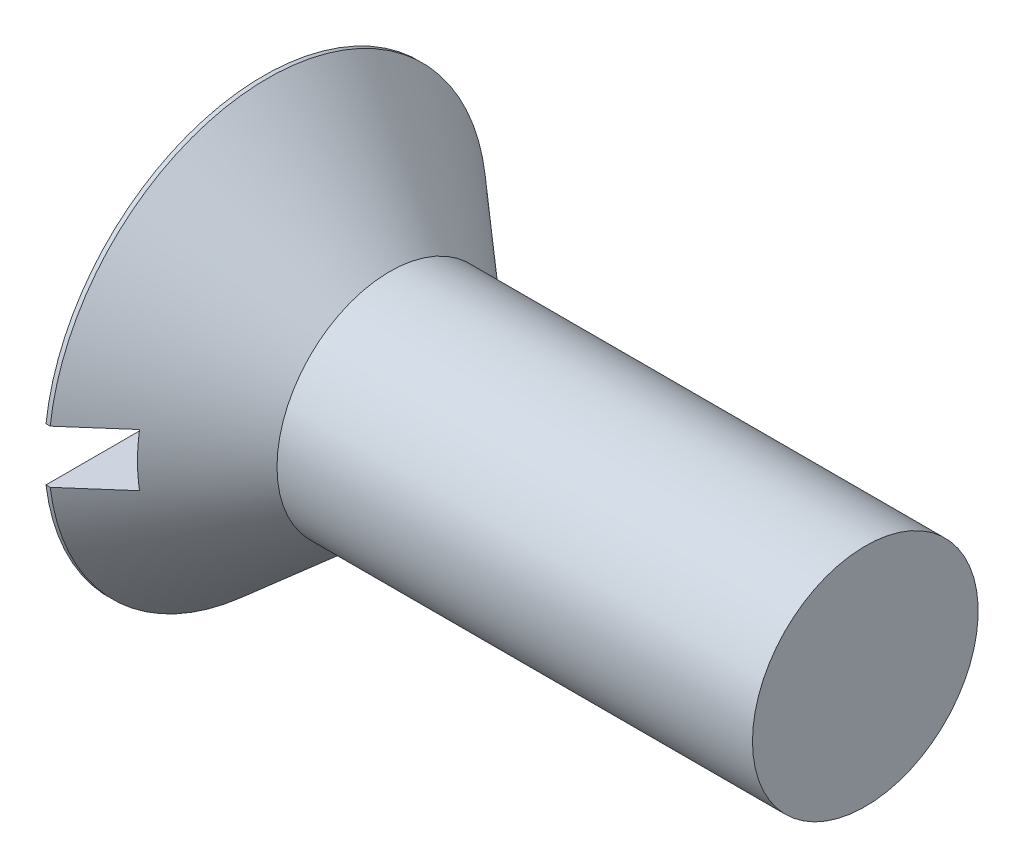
ISO-10303-21;
HEADER;
FILE_DESCRIPTION(('STEP AP214'),'2;1');
FILE_NAME('part.step','',(''),(''),'','','');
FILE_SCHEMA(('AUTOMOTIVE_DESIGN { 1 0 10303 214 1 1 1 1 }'));
ENDSEC;
DATA;
#1=APPLICATION_CONTEXT('core data for automotive mechanical design processes');
#2=APPLICATION_PROTOCOL_DEFINITION('international standard','automotive_design',2000,#1);
#3=PRODUCT_CONTEXT('',#1,'mechanical');
#4=PRODUCT('Part','Part','',(#3));
#5=PRODUCT_RELATED_PRODUCT_CATEGORY('part','',(#4));
#6=PRODUCT_DEFINITION_FORMATION('','',#4);
#7=PRODUCT_DEFINITION_CONTEXT('part definition',#1,'design');
#8=PRODUCT_DEFINITION('design','',#6,#7);
#9=PRODUCT_DEFINITION_SHAPE('','',#8);
#10=(LENGTH_UNIT() NAMED_UNIT(*) SI_UNIT(.MILLI.,.METRE.));
#11=(NAMED_UNIT(*) PLANE_ANGLE_UNIT() SI_UNIT($,.RADIAN.));
#12=(NAMED_UNIT(*) SI_UNIT($,.STERADIAN.) SOLID_ANGLE_UNIT());
#13=UNCERTAINTY_MEASURE_WITH_UNIT(LENGTH_MEASURE(1.E-05),#10,'distance_accuracy_value','');
#14=(GEOMETRIC_REPRESENTATION_CONTEXT(3) GLOBAL_UNCERTAINTY_ASSIGNED_CONTEXT((#13)) GLOBAL_UNIT_ASSIGNED_CONTEXT((#10,
#11,#12)) REPRESENTATION_CONTEXT('',''));
#15=CARTESIAN_POINT('',(0.,0.,0.));
#16=DIRECTION('',(0.,0.,1.));
#17=DIRECTION('',(1.,0.,0.));
#18=AXIS2_PLACEMENT_3D('',#15,#16,#17);
#19=CARTESIAN_POINT('',(0.,0.,0.));
#20=DIRECTION('',(-1.,0.,0.));
#21=DIRECTION('',(0.,0.,1.));
#22=AXIS2_PLACEMENT_3D('',#19,#20,#21);
#23=PLANE('',#22);
#24=DIRECTION('',(0.,0.,-1.));
#25=VECTOR('',#24,1.);
#26=CARTESIAN_POINT('',(0.,1.1176,9.2456));
#27=LINE('',#26,#25);
#28=CARTESIAN_POINT('',(0.,1.1176,9.17780418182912));
#29=VERTEX_POINT('',#28);
#30=CARTESIAN_POINT('',(0.,1.1176,-9.17780418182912));
#31=VERTEX_POINT('',#30);
#32=EDGE_CURVE('E160',#29,#31,#27,.T.);
#33=ORIENTED_EDGE('',*,*,#32,.F.);
#34=CARTESIAN_POINT('',(0.,0.,0.));
#35=DIRECTION('',(-1.,0.,0.));
#36=DIRECTION('',(0.,0.,1.));
#37=AXIS2_PLACEMENT_3D('',#34,#35,#36);
#38=CIRCLE('',#37,9.2456);
#39=EDGE_CURVE('E111',#29,#31,#38,.T.);
#40=ORIENTED_EDGE('',*,*,#39,.T.);
#41=EDGE_LOOP('',(#33,#40));
#42=FACE_BOUND('',#41,.T.);
#43=ADVANCED_FACE('F30',(#42),#23,.T.);
#44=CARTESIAN_POINT('',(-6.34999999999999,0.,0.));
#45=DIRECTION('',(-1.,0.,0.));
#46=DIRECTION('',(0.,0.,1.));
#47=AXIS2_PLACEMENT_3D('',#44,#45,#46);
#48=CYLINDRICAL_SURFACE('',#47,9.2456);
#49=DIRECTION('',(-1.,0.,0.));
#50=VECTOR('',#49,1.);
#51=CARTESIAN_POINT('',(-6.34999999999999,1.1176,-9.17780418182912));
#52=LINE('',#51,#50);
#53=CARTESIAN_POINT('',(0.17678339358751,1.1176,-9.17780418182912));
#54=VERTEX_POINT('',#53);
#55=EDGE_CURVE('E58',#31,#54,#52,.F.);
#56=ORIENTED_EDGE('',*,*,#55,.F.);
#57=ORIENTED_EDGE('',*,*,#39,.F.);
#58=DIRECTION('',(-1.,0.,0.));
#59=VECTOR('',#58,1.);
#60=CARTESIAN_POINT('',(-6.34999999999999,1.1176,9.17780418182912));
#61=LINE('',#60,#59);
#62=CARTESIAN_POINT('',(0.17678339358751,1.1176,9.17780418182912));
#63=VERTEX_POINT('',#62);
#64=EDGE_CURVE('E166',#63,#29,#61,.T.);
#65=ORIENTED_EDGE('',*,*,#64,.F.);
#66=CARTESIAN_POINT('',(0.17678339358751,0.,0.));
#67=DIRECTION('',(-1.,0.,0.));
#68=DIRECTION('',(0.,0.,1.));
#69=AXIS2_PLACEMENT_3D('',#66,#67,#68);
#70=CIRCLE('',#69,9.2456);
#71=EDGE_CURVE('E105',#63,#54,#70,.T.);
#72=ORIENTED_EDGE('',*,*,#71,.T.);
#73=EDGE_LOOP('',(#56,#57,#65,#72));
#74=FACE_BOUND('',#73,.T.);
#75=ADVANCED_FACE('F145',(#74),#48,.T.);
#76=DIRECTION('',(0.,0.,1.));
#77=VECTOR('',#76,1.);
#78=CARTESIAN_POINT('',(0.,-1.1176,-9.2456));
#79=LINE('',#78,#77);
#80=CARTESIAN_POINT('',(0.,-1.1176,-9.17780418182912));
#81=VERTEX_POINT('',#80);
#82=CARTESIAN_POINT('',(0.,-1.1176,9.17780418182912));
#83=VERTEX_POINT('',#82);
#84=EDGE_CURVE('E99',#81,#83,#79,.T.);
#85=ORIENTED_EDGE('',*,*,#84,.F.);
#86=EDGE_CURVE('E107',#81,#83,#38,.T.);
#87=ORIENTED_EDGE('',*,*,#86,.T.);
#88=EDGE_LOOP('',(#85,#87));
#89=FACE_BOUND('',#88,.T.);
#90=ADVANCED_FACE('F32',(#89),#23,.T.);
#91=DIRECTION('',(-1.,0.,0.));
#92=VECTOR('',#91,1.);
#93=CARTESIAN_POINT('',(-6.34999999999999,-1.1176,9.17780418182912));
#94=LINE('',#93,#92);
#95=CARTESIAN_POINT('',(0.17678339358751,-1.1176,9.17780418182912));
#96=VERTEX_POINT('',#95);
#97=EDGE_CURVE('E165',#83,#96,#94,.F.);
#98=ORIENTED_EDGE('',*,*,#97,.F.);
#99=ORIENTED_EDGE('',*,*,#86,.F.);
#100=DIRECTION('',(-1.,0.,0.));
#101=VECTOR('',#100,1.);
#102=CARTESIAN_POINT('',(-6.34999999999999,-1.1176,-9.17780418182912));
#103=LINE('',#102,#101);
#104=CARTESIAN_POINT('',(0.17678339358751,-1.1176,-9.17780418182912));
#105=VERTEX_POINT('',#104);
#106=EDGE_CURVE('E163',#105,#81,#103,.T.);
#107=ORIENTED_EDGE('',*,*,#106,.F.);
#108=EDGE_CURVE('E108',#105,#96,#70,.T.);
#109=ORIENTED_EDGE('',*,*,#108,.T.);
#110=EDGE_LOOP('',(#98,#99,#107,#109));
#111=FACE_BOUND('',#110,.T.);
#112=ADVANCED_FACE('F141',(#111),#48,.T.);
#113=CARTESIAN_POINT('',(0.17678339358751,0.,0.));
#114=DIRECTION('',(-1.,0.,0.));
#115=DIRECTION('',(0.,0.,1.));
#116=AXIS2_PLACEMENT_3D('',#113,#114,#115);
#117=CONICAL_SURFACE('',#116,9.2456,0.715584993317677);
#118=CARTESIAN_POINT('',(-10.9833359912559,1.1176,-18.9139538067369));
#119=CARTESIAN_POINT('',(-10.256723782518,1.1176,-18.2812095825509));
#120=CARTESIAN_POINT('',(-9.53015867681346,1.1176,-17.6484112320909));
#121=CARTESIAN_POINT('',(-8.07717697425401,1.1176,-16.3826367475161));
#122=CARTESIAN_POINT('',(-7.35076037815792,1.1176,-15.7496606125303));
#123=CARTESIAN_POINT('',(-5.89796190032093,1.1176,-14.4833144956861));
#124=CARTESIAN_POINT('',(-5.1715800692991,1.1176,-13.8499444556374));
#125=CARTESIAN_POINT('',(-3.71913334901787,1.1176,-12.5828479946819));
#126=CARTESIAN_POINT('',(-2.99306845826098,1.1176,-11.9491215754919));
#127=CARTESIAN_POINT('',(-1.55680914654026,1.1176,-10.6945245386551));
#128=CARTESIAN_POINT('',(-0.846604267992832,1.1176,-10.0736658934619));
#129=CARTESIAN_POINT('',(0.573018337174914,1.1176,-8.83102862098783));
#130=CARTESIAN_POINT('',(1.28243605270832,1.1176,-8.20924998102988));
#131=CARTESIAN_POINT('',(2.34532890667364,1.1176,-7.27530841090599));
#132=CARTESIAN_POINT('',(2.69938850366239,1.1176,-6.9638109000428));
#133=CARTESIAN_POINT('',(3.40691988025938,1.1176,-6.34014563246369));
#134=CARTESIAN_POINT('',(3.76039165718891,1.1176,-6.0279778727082));
#135=CARTESIAN_POINT('',(4.46641901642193,1.1176,-5.40262439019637));
#136=CARTESIAN_POINT('',(4.81897462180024,1.1176,-5.08943869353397));
#137=CARTESIAN_POINT('',(5.34663445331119,1.1176,-4.61834787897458));
#138=CARTESIAN_POINT('',(5.52232481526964,1.1176,-4.46109948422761));
#139=CARTESIAN_POINT('',(5.8731674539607,1.1176,-4.14600378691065));
#140=CARTESIAN_POINT('',(6.04831973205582,1.1176,-3.98815648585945));
#141=CARTESIAN_POINT('',(6.31509054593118,1.1176,-3.74658262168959));
#142=CARTESIAN_POINT('',(6.40698298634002,1.1176,-3.6631585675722));
#143=CARTESIAN_POINT('',(6.5905095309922,1.1176,-3.49602621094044));
#144=CARTESIAN_POINT('',(6.68214363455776,1.1176,-3.41231790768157));
#145=CARTESIAN_POINT('',(6.9566143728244,1.1176,-3.16063773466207));
#146=CARTESIAN_POINT('',(7.13897725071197,1.1176,-2.99214870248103));
#147=CARTESIAN_POINT('',(7.50276913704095,1.1176,-2.65204978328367));
#148=CARTESIAN_POINT('',(7.68418660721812,1.1176,-2.48042746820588));
#149=CARTESIAN_POINT('',(7.9535472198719,1.1176,-2.22022346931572));
#150=CARTESIAN_POINT('',(8.04284939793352,1.1176,-2.13305098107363));
#151=CARTESIAN_POINT('',(8.22016572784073,1.1176,-1.95740810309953));
#152=CARTESIAN_POINT('',(8.30817993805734,1.1176,-1.86893777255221));
#153=CARTESIAN_POINT('',(8.48200146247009,1.1176,-1.6905101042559));
#154=CARTESIAN_POINT('',(8.56781594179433,1.1176,-1.60055976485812));
#155=CARTESIAN_POINT('',(8.73673369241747,1.1176,-1.41787226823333));
#156=CARTESIAN_POINT('',(8.81983294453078,1.1176,-1.3251313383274));
#157=CARTESIAN_POINT('',(8.94075470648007,1.1176,-1.18310122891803));
#158=CARTESIAN_POINT('',(8.9803795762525,1.1176,-1.13535111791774));
#159=CARTESIAN_POINT('',(9.05801467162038,1.1176,-1.03856066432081));
#160=CARTESIAN_POINT('',(9.09602518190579,1.1176,-0.989520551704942));
#161=CARTESIAN_POINT('',(9.16977087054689,1.1176,-0.889906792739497));
#162=CARTESIAN_POINT('',(9.20551067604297,1.1176,-0.839336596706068));
#163=CARTESIAN_POINT('',(9.27389389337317,1.1176,-0.736159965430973));
#164=CARTESIAN_POINT('',(9.30653951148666,1.1176,-0.68355501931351));
#165=CARTESIAN_POINT('',(9.35864055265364,1.1176,-0.591280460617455));
#166=CARTESIAN_POINT('',(9.37919166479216,1.1176,-0.552234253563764));
#167=CARTESIAN_POINT('',(9.41733372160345,1.1176,-0.472688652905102));
#168=CARTESIAN_POINT('',(9.43492392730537,1.1176,-0.432188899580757));
#169=CARTESIAN_POINT('',(9.46612262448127,1.1176,-0.350040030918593));
#170=CARTESIAN_POINT('',(9.47976315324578,1.1176,-0.308403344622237));
#171=CARTESIAN_POINT('',(9.50228849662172,1.1176,-0.223884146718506));
#172=CARTESIAN_POINT('',(9.51117770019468,1.1176,-0.181002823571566));
#173=CARTESIAN_POINT('',(9.52562676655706,1.1176,-0.0780643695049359));
#174=CARTESIAN_POINT('',(9.52867201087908,1.1176,-0.0176206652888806));
#175=CARTESIAN_POINT('',(9.52341673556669,1.1176,0.102811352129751));
#176=CARTESIAN_POINT('',(9.51509854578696,1.1176,0.162798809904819));
#177=CARTESIAN_POINT('',(9.48465314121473,1.1176,0.298934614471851));
#178=CARTESIAN_POINT('',(9.45902211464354,1.1176,0.37427306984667));
#179=CARTESIAN_POINT('',(9.41230274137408,1.1176,0.483649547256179));
#180=CARTESIAN_POINT('',(9.39529338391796,1.1176,0.519595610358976));
#181=CARTESIAN_POINT('',(9.35907984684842,1.1176,0.590366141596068));
#182=CARTESIAN_POINT('',(9.33987621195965,1.1176,0.62519088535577));
#183=CARTESIAN_POINT('',(9.28581213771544,1.1176,0.717679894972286));
#184=CARTESIAN_POINT('',(9.24934593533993,1.1176,0.774396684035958));
#185=CARTESIAN_POINT('',(9.17309120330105,1.1176,0.885569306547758));
#186=CARTESIAN_POINT('',(9.13330018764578,1.1176,0.940023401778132));
#187=CARTESIAN_POINT('',(9.05131763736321,1.1176,1.04728296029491));
#188=CARTESIAN_POINT('',(9.00912069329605,1.1176,1.10008425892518));
#189=CARTESIAN_POINT('',(8.9230527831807,1.1176,1.20430942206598));
#190=CARTESIAN_POINT('',(8.87918152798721,1.1176,1.2557330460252));
#191=CARTESIAN_POINT('',(8.74521422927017,1.1176,1.40900252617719));
#192=CARTESIAN_POINT('',(8.6532604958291,1.1176,1.50922143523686));
#193=CARTESIAN_POINT('',(8.51325843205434,1.1176,1.65740406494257));
#194=CARTESIAN_POINT('',(8.46628379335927,1.1176,1.70640275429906));
#195=CARTESIAN_POINT('',(8.37174822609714,1.1176,1.80383063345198));
#196=CARTESIAN_POINT('',(8.32418731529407,1.1176,1.85225984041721));
#197=CARTESIAN_POINT('',(8.18225230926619,1.1176,1.9953986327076));
#198=CARTESIAN_POINT('',(8.08720933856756,1.1176,2.08944378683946));
#199=CARTESIAN_POINT('',(7.89589173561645,1.1176,2.27627531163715));
#200=CARTESIAN_POINT('',(7.79961705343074,1.1176,2.36906163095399));
#201=CARTESIAN_POINT('',(7.50947342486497,1.1176,2.64608339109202));
#202=CARTESIAN_POINT('',(7.31430786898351,1.1176,2.82895886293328));
#203=CARTESIAN_POINT('',(6.92188060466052,1.1176,3.19280581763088));
#204=CARTESIAN_POINT('',(6.72461709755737,1.1176,3.37377534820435));
#205=CARTESIAN_POINT('',(6.32889736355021,1.1176,3.73437567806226));
#206=CARTESIAN_POINT('',(6.13044122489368,1.1176,3.91400657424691));
#207=CARTESIAN_POINT('',(5.73407494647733,1.1176,4.27117172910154));
#208=CARTESIAN_POINT('',(5.53617017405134,1.1176,4.44871195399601));
#209=CARTESIAN_POINT('',(5.13980533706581,1.1176,4.80317867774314));
#210=CARTESIAN_POINT('',(4.94134526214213,1.1176,4.98010516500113));
#211=CARTESIAN_POINT('',(4.54410670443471,1.1176,5.33343578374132));
#212=CARTESIAN_POINT('',(4.34532838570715,1.1176,5.50984009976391));
#213=CARTESIAN_POINT('',(3.94747117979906,1.1176,5.86230692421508));
#214=CARTESIAN_POINT('',(3.74839229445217,1.1176,6.03836943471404));
#215=CARTESIAN_POINT('',(2.95034989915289,1.1176,6.7432417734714));
#216=CARTESIAN_POINT('',(2.35048617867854,1.1176,7.27103210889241));
#217=CARTESIAN_POINT('',(1.14974461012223,1.1176,8.32546065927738));
#218=CARTESIAN_POINT('',(0.548866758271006,1.1176,8.85209886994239));
#219=CARTESIAN_POINT('',(-0.653600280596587,1.1176,9.90478404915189));
#220=CARTESIAN_POINT('',(-1.25518957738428,1.1176,10.430830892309));
#221=CARTESIAN_POINT('',(-2.45874487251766,1.1176,11.4824916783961));
#222=CARTESIAN_POINT('',(-3.06071087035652,1.1176,12.0081056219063));
#223=CARTESIAN_POINT('',(-4.27255602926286,1.1176,13.0657259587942));
#224=CARTESIAN_POINT('',(-4.88243844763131,1.1176,13.5977286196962));
#225=CARTESIAN_POINT('',(-6.10238626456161,1.1176,14.6615246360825));
#226=CARTESIAN_POINT('',(-6.71245166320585,1.1176,15.1933179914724));
#227=CARTESIAN_POINT('',(-7.93259720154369,1.1176,16.2566500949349));
#228=CARTESIAN_POINT('',(-8.54267731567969,1.1176,16.7881888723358));
#229=CARTESIAN_POINT('',(-9.76293857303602,1.1176,17.851149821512));
#230=CARTESIAN_POINT('',(-10.3731197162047,1.1176,18.3825719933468));
#231=CARTESIAN_POINT('',(-10.9833359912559,1.1176,18.9139538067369));
#232=B_SPLINE_CURVE_WITH_KNOTS('',3,(#118,#119,#120,#121,#122,#123,#124,#125,#126,#127,#128,
#129,#130,#131,#132,#133,#134,#135,#136,#137,#138,#139,#140,#141,#142,#143,#144,#145,#146,#147,
#148,#149,#150,#151,#152,#153,#154,#155,#156,#157,#158,#159,#160,#161,#162,#163,#164,#165,#166,
#167,#168,#169,#170,#171,#172,#173,#174,#175,#176,#177,#178,#179,#180,#181,#182,#183,#184,#185,
#186,#187,#188,#189,#190,#191,#192,#193,#194,#195,#196,#197,#198,#199,#200,#201,#202,#203,#204,
#205,#206,#207,#208,#209,#210,#211,#212,#213,#214,#215,#216,#217,#218,#219,#220,#221,#222,#223,
#224,#225,#226,#227,#228,#229,#230,#231),.UNSPECIFIED.,.F.,.F.,(4,2,2,2,2,2,2,2,2,2,2,2,2,2,2,2,
2,2,2,2,2,2,2,2,2,2,2,2,2,2,2,2,2,2,2,2,2,2,2,2,2,2,2,2,2,2,2,2,2,2,2,2,2,2,2,2,4),(0.,
2.89049739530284,5.78100920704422,8.67221884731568,11.5634146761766,14.3933804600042,
17.2233856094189,18.6381288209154,20.0528784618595,21.4675921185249,22.1749436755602,
22.8822934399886,23.2546290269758,23.6269655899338,24.3718092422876,25.1209698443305,
25.4953478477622,25.8697088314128,26.242635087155,26.6160904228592,26.8022159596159,
26.9883085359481,27.1740088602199,27.359575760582,27.4918545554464,27.6241663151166,
27.7553726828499,27.8864576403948,28.0669099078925,28.2476430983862,28.4848725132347,
28.6041353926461,28.7233687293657,28.9254679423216,29.1277196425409,29.3304455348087,
29.5332065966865,29.9411204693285,30.1447556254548,30.3483846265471,30.74948828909,
31.1506082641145,31.9529452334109,32.7560367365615,33.5590695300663,34.3566778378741,
35.1543011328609,35.9515971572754,36.7488883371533,39.1458808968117,41.54288238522,
43.9403211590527,46.3377567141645,48.765687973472,51.193620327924,53.621084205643,
56.0485468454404),.UNSPECIFIED.);
#233=CARTESIAN_POINT('',(2.1844,1.1176,7.41667398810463));
#234=VERTEX_POINT('',#233);
#235=EDGE_CURVE('E11',#234,#63,#232,.T.);
#236=ORIENTED_EDGE('',*,*,#235,.F.);
#237=CARTESIAN_POINT('',(2.1844,0.,0.));
#238=DIRECTION('',(1.,0.,0.));
#239=DIRECTION('',(0.,0.,-1.));
#240=AXIS2_PLACEMENT_3D('',#237,#238,#239);
#241=CIRCLE('',#240,7.500405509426);
#242=CARTESIAN_POINT('',(2.1844,-1.1176,7.41667398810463));
#243=VERTEX_POINT('',#242);
#244=EDGE_CURVE('E87',#243,#234,#241,.F.);
#245=ORIENTED_EDGE('',*,*,#244,.F.);
#246=CARTESIAN_POINT('',(-10.9833359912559,-1.1176,18.9139538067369));
#247=CARTESIAN_POINT('',(-10.256723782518,-1.1176,18.2812095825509));
#248=CARTESIAN_POINT('',(-9.53015867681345,-1.1176,17.6484112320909));
#249=CARTESIAN_POINT('',(-8.07717697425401,-1.1176,16.3826367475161));
#250=CARTESIAN_POINT('',(-7.35076037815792,-1.1176,15.7496606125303));
#251=CARTESIAN_POINT('',(-5.89796190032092,-1.1176,14.4833144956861));
#252=CARTESIAN_POINT('',(-5.1715800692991,-1.1176,13.8499444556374));
#253=CARTESIAN_POINT('',(-3.71913334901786,-1.1176,12.5828479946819));
#254=CARTESIAN_POINT('',(-2.99306845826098,-1.1176,11.9491215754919));
#255=CARTESIAN_POINT('',(-1.55680914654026,-1.1176,10.6945245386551));
#256=CARTESIAN_POINT('',(-0.846604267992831,-1.1176,10.0736658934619));
#257=CARTESIAN_POINT('',(0.573018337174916,-1.1176,8.83102862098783));
#258=CARTESIAN_POINT('',(1.28243605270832,-1.1176,8.20924998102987));
#259=CARTESIAN_POINT('',(2.34532890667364,-1.1176,7.27530841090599));
#260=CARTESIAN_POINT('',(2.69938850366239,-1.1176,6.96381090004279));
#261=CARTESIAN_POINT('',(3.40691988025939,-1.1176,6.34014563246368));
#262=CARTESIAN_POINT('',(3.76039165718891,-1.1176,6.0279778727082));
#263=CARTESIAN_POINT('',(4.46641901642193,-1.1176,5.40262439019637));
#264=CARTESIAN_POINT('',(4.81897462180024,-1.1176,5.08943869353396));
#265=CARTESIAN_POINT('',(5.3466344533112,-1.1176,4.61834787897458));
#266=CARTESIAN_POINT('',(5.52232481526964,-1.1176,4.46109948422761));
#267=CARTESIAN_POINT('',(5.8731674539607,-1.1176,4.14600378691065));
#268=CARTESIAN_POINT('',(6.04831973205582,-1.1176,3.98815648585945));
#269=CARTESIAN_POINT('',(6.31509054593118,-1.1176,3.74658262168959));
#270=CARTESIAN_POINT('',(6.40698298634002,-1.1176,3.66315856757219));
#271=CARTESIAN_POINT('',(6.59050953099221,-1.1176,3.49602621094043));
#272=CARTESIAN_POINT('',(6.68214363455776,-1.1176,3.41231790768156));
#273=CARTESIAN_POINT('',(6.9566143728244,-1.1176,3.16063773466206));
#274=CARTESIAN_POINT('',(7.13897725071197,-1.1176,2.99214870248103));
#275=CARTESIAN_POINT('',(7.50276913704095,-1.1176,2.65204978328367));
#276=CARTESIAN_POINT('',(7.68418660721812,-1.1176,2.48042746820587));
#277=CARTESIAN_POINT('',(7.9535472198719,-1.1176,2.22022346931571));
#278=CARTESIAN_POINT('',(8.04284939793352,-1.1176,2.13305098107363));
#279=CARTESIAN_POINT('',(8.22016572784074,-1.1176,1.95740810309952));
#280=CARTESIAN_POINT('',(8.30817993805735,-1.1176,1.8689377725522));
#281=CARTESIAN_POINT('',(8.48200146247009,-1.1176,1.6905101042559));
#282=CARTESIAN_POINT('',(8.56781594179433,-1.1176,1.60055976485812));
#283=CARTESIAN_POINT('',(8.73673369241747,-1.1176,1.41787226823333));
#284=CARTESIAN_POINT('',(8.81983294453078,-1.1176,1.3251313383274));
#285=CARTESIAN_POINT('',(8.94075470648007,-1.1176,1.18310122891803));
#286=CARTESIAN_POINT('',(8.9803795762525,-1.1176,1.13535111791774));
#287=CARTESIAN_POINT('',(9.05801467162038,-1.1176,1.03856066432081));
#288=CARTESIAN_POINT('',(9.09602518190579,-1.1176,0.989520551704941));
#289=CARTESIAN_POINT('',(9.16977087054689,-1.1176,0.889906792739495));
#290=CARTESIAN_POINT('',(9.20551067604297,-1.1176,0.839336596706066));
#291=CARTESIAN_POINT('',(9.27389389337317,-1.1176,0.73615996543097));
#292=CARTESIAN_POINT('',(9.30653951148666,-1.1176,0.683555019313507));
#293=CARTESIAN_POINT('',(9.35864055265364,-1.1176,0.591280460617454));
#294=CARTESIAN_POINT('',(9.37919166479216,-1.1176,0.552234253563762));
#295=CARTESIAN_POINT('',(9.41733372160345,-1.1176,0.4726886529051));
#296=CARTESIAN_POINT('',(9.43492392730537,-1.1176,0.432188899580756));
#297=CARTESIAN_POINT('',(9.46612262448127,-1.1176,0.350040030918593));
#298=CARTESIAN_POINT('',(9.47976315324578,-1.1176,0.308403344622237));
#299=CARTESIAN_POINT('',(9.50228849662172,-1.1176,0.223884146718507));
#300=CARTESIAN_POINT('',(9.51117770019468,-1.1176,0.181002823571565));
#301=CARTESIAN_POINT('',(9.52562676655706,-1.1176,0.0780643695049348));
#302=CARTESIAN_POINT('',(9.52867201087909,-1.1176,0.0176206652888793));
#303=CARTESIAN_POINT('',(9.52341673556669,-1.1176,-0.102811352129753));
#304=CARTESIAN_POINT('',(9.51509854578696,-1.1176,-0.16279880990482));
#305=CARTESIAN_POINT('',(9.48465314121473,-1.1176,-0.298934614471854));
#306=CARTESIAN_POINT('',(9.45902211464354,-1.1176,-0.374273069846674));
#307=CARTESIAN_POINT('',(9.41230274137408,-1.1176,-0.483649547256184));
#308=CARTESIAN_POINT('',(9.39529338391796,-1.1176,-0.51959561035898));
#309=CARTESIAN_POINT('',(9.35907984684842,-1.1176,-0.590366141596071));
#310=CARTESIAN_POINT('',(9.33987621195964,-1.1176,-0.625190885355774));
#311=CARTESIAN_POINT('',(9.28581213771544,-1.1176,-0.717679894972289));
#312=CARTESIAN_POINT('',(9.24934593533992,-1.1176,-0.774396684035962));
#313=CARTESIAN_POINT('',(9.17309120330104,-1.1176,-0.885569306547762));
#314=CARTESIAN_POINT('',(9.13330018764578,-1.1176,-0.940023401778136));
#315=CARTESIAN_POINT('',(9.05131763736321,-1.1176,-1.04728296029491));
#316=CARTESIAN_POINT('',(9.00912069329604,-1.1176,-1.10008425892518));
#317=CARTESIAN_POINT('',(8.9230527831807,-1.1176,-1.20430942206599));
#318=CARTESIAN_POINT('',(8.87918152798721,-1.1176,-1.2557330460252));
#319=CARTESIAN_POINT('',(8.74521422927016,-1.1176,-1.40900252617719));
#320=CARTESIAN_POINT('',(8.65326049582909,-1.1176,-1.50922143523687));
#321=CARTESIAN_POINT('',(8.51325843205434,-1.1176,-1.65740406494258));
#322=CARTESIAN_POINT('',(8.46628379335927,-1.1176,-1.70640275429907));
#323=CARTESIAN_POINT('',(8.37174822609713,-1.1176,-1.80383063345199));
#324=CARTESIAN_POINT('',(8.32418731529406,-1.1176,-1.85225984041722));
#325=CARTESIAN_POINT('',(8.18225230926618,-1.1176,-1.99539863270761));
#326=CARTESIAN_POINT('',(8.08720933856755,-1.1176,-2.08944378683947));
#327=CARTESIAN_POINT('',(7.89589173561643,-1.1176,-2.27627531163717));
#328=CARTESIAN_POINT('',(7.79961705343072,-1.1176,-2.36906163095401));
#329=CARTESIAN_POINT('',(7.50947342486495,-1.1176,-2.64608339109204));
#330=CARTESIAN_POINT('',(7.31430786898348,-1.1176,-2.8289588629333));
#331=CARTESIAN_POINT('',(6.9218806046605,-1.1176,-3.1928058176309));
#332=CARTESIAN_POINT('',(6.72461709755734,-1.1176,-3.37377534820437));
#333=CARTESIAN_POINT('',(6.32889736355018,-1.1176,-3.73437567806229));
#334=CARTESIAN_POINT('',(6.13044122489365,-1.1176,-3.91400657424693));
#335=CARTESIAN_POINT('',(5.73407494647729,-1.1176,-4.27117172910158));
#336=CARTESIAN_POINT('',(5.5361701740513,-1.1176,-4.44871195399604));
#337=CARTESIAN_POINT('',(5.13980533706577,-1.1176,-4.80317867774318));
#338=CARTESIAN_POINT('',(4.94134526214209,-1.1176,-4.98010516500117));
#339=CARTESIAN_POINT('',(4.54410670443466,-1.1176,-5.33343578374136));
#340=CARTESIAN_POINT('',(4.34532838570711,-1.1176,-5.50984009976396));
#341=CARTESIAN_POINT('',(3.94747117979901,-1.1176,-5.86230692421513));
#342=CARTESIAN_POINT('',(3.74839229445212,-1.1176,-6.03836943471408));
#343=CARTESIAN_POINT('',(2.95034989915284,-1.1176,-6.74324177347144));
#344=CARTESIAN_POINT('',(2.35048617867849,-1.1176,-7.27103210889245));
#345=CARTESIAN_POINT('',(1.1497446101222,-1.1176,-8.32546065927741));
#346=CARTESIAN_POINT('',(0.54886675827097,-1.1176,-8.85209886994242));
#347=CARTESIAN_POINT('',(-0.65360028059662,-1.1176,-9.90478404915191));
#348=CARTESIAN_POINT('',(-1.25518957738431,-1.1176,-10.4308308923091));
#349=CARTESIAN_POINT('',(-2.45874487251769,-1.1176,-11.4824916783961));
#350=CARTESIAN_POINT('',(-3.06071087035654,-1.1176,-12.0081056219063));
#351=CARTESIAN_POINT('',(-4.27255602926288,-1.1176,-13.0657259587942));
#352=CARTESIAN_POINT('',(-4.88243844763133,-1.1176,-13.5977286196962));
#353=CARTESIAN_POINT('',(-6.10238626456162,-1.1176,-14.6615246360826));
#354=CARTESIAN_POINT('',(-6.71245166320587,-1.1176,-15.1933179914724));
#355=CARTESIAN_POINT('',(-7.93259720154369,-1.1176,-16.2566500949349));
#356=CARTESIAN_POINT('',(-8.5426773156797,-1.1176,-16.7881888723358));
#357=CARTESIAN_POINT('',(-9.76293857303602,-1.1176,-17.851149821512));
#358=CARTESIAN_POINT('',(-10.3731197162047,-1.1176,-18.3825719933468));
#359=CARTESIAN_POINT('',(-10.9833359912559,-1.1176,-18.9139538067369));
#360=B_SPLINE_CURVE_WITH_KNOTS('',3,(#246,#247,#248,#249,#250,#251,#252,#253,#254,#255,#256,
#257,#258,#259,#260,#261,#262,#263,#264,#265,#266,#267,#268,#269,#270,#271,#272,#273,#274,#275,
#276,#277,#278,#279,#280,#281,#282,#283,#284,#285,#286,#287,#288,#289,#290,#291,#292,#293,#294,
#295,#296,#297,#298,#299,#300,#301,#302,#303,#304,#305,#306,#307,#308,#309,#310,#311,#312,#313,
#314,#315,#316,#317,#318,#319,#320,#321,#322,#323,#324,#325,#326,#327,#328,#329,#330,#331,#332,
#333,#334,#335,#336,#337,#338,#339,#340,#341,#342,#343,#344,#345,#346,#347,#348,#349,#350,#351,
#352,#353,#354,#355,#356,#357,#358,#359),.UNSPECIFIED.,.F.,.F.,(4,2,2,2,2,2,2,2,2,2,2,2,2,2,2,2,
2,2,2,2,2,2,2,2,2,2,2,2,2,2,2,2,2,2,2,2,2,2,2,2,2,2,2,2,2,2,2,2,2,2,2,2,2,2,2,2,4),(0.,
2.89049739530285,5.78100920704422,8.67221884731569,11.5634146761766,14.3933804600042,
17.2233856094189,18.6381288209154,20.0528784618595,21.4675921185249,22.1749436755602,
22.8822934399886,23.2546290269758,23.6269655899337,24.3718092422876,25.1209698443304,
25.4953478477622,25.8697088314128,26.242635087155,26.6160904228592,26.8022159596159,
26.9883085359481,27.1740088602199,27.359575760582,27.4918545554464,27.6241663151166,
27.7553726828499,27.8864576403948,28.0669099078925,28.2476430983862,28.4848725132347,
28.6041353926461,28.7233687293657,28.9254679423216,29.1277196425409,29.3304455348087,
29.5332065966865,29.9411204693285,30.1447556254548,30.3483846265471,30.74948828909,
31.1506082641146,31.9529452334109,32.7560367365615,33.5590695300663,34.3566778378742,
35.154301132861,35.9515971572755,36.7488883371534,39.1458808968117,41.5428823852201,
43.9403211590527,46.3377567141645,48.7656879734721,51.193620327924,53.621084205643,
56.0485468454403),.UNSPECIFIED.);
#361=EDGE_CURVE('E44',#96,#243,#360,.T.);
#362=ORIENTED_EDGE('',*,*,#361,.F.);
#363=ORIENTED_EDGE('',*,*,#108,.F.);
#364=CARTESIAN_POINT('',(2.1844,-1.1176,-7.41667398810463));
#365=VERTEX_POINT('',#364);
#366=EDGE_CURVE('E117',#365,#105,#360,.T.);
#367=ORIENTED_EDGE('',*,*,#366,.F.);
#368=CARTESIAN_POINT('',(2.1844,1.1176,-7.41667398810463));
#369=VERTEX_POINT('',#368);
#370=EDGE_CURVE('E95',#369,#365,#241,.F.);
#371=ORIENTED_EDGE('',*,*,#370,.F.);
#372=EDGE_CURVE('E34',#54,#369,#232,.T.);
#373=ORIENTED_EDGE('',*,*,#372,.F.);
#374=ORIENTED_EDGE('',*,*,#71,.F.);
#375=EDGE_LOOP('',(#236,#245,#362,#363,#367,#371,#373,#374));
#376=FACE_BOUND('',#375,.T.);
#377=CARTESIAN_POINT('',(5.334,0.,0.));
#378=DIRECTION('',(-1.,0.,0.));
#379=DIRECTION('',(0.,0.,1.));
#380=AXIS2_PLACEMENT_3D('',#377,#378,#379);
#381=CIRCLE('',#380,4.7625);
#382=CARTESIAN_POINT('',(5.334,0.,4.7625));
#383=VERTEX_POINT('',#382);
#384=EDGE_CURVE('E114',#383,#383,#381,.T.);
#385=ORIENTED_EDGE('',*,*,#384,.T.);
#386=EDGE_LOOP('',(#385));
#387=FACE_BOUND('',#386,.T.);
#388=ADVANCED_FACE('F102',(#376,#387),#117,.T.);
#389=CARTESIAN_POINT('',(-6.34999999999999,0.,0.));
#390=DIRECTION('',(-1.,0.,0.));
#391=DIRECTION('',(0.,0.,1.));
#392=AXIS2_PLACEMENT_3D('',#389,#390,#391);
#393=CYLINDRICAL_SURFACE('',#392,4.7625);
#394=CARTESIAN_POINT('',(25.4,0.,0.));
#395=DIRECTION('',(-1.,0.,0.));
#396=DIRECTION('',(0.,0.,1.));
#397=AXIS2_PLACEMENT_3D('',#394,#395,#396);
#398=CIRCLE('',#397,4.7625);
#399=CARTESIAN_POINT('',(25.4,0.,4.7625));
#400=VERTEX_POINT('',#399);
#401=EDGE_CURVE('E171',#400,#400,#398,.T.);
#402=ORIENTED_EDGE('',*,*,#401,.T.);
#403=EDGE_LOOP('',(#402));
#404=FACE_BOUND('',#403,.T.);
#405=ORIENTED_EDGE('',*,*,#384,.F.);
#406=EDGE_LOOP('',(#405));
#407=FACE_BOUND('',#406,.T.);
#408=ADVANCED_FACE('F134',(#404,#407),#393,.T.);
#409=CARTESIAN_POINT('',(25.4,4.7625,0.));
#410=DIRECTION('',(1.,0.,0.));
#411=DIRECTION('',(0.,0.,-1.));
#412=AXIS2_PLACEMENT_3D('',#409,#410,#411);
#413=PLANE('',#412);
#414=ORIENTED_EDGE('',*,*,#401,.F.);
#415=EDGE_LOOP('',(#414));
#416=FACE_BOUND('',#415,.T.);
#417=ADVANCED_FACE('F132',(#416),#413,.T.);
#418=CARTESIAN_POINT('',(2.1844,1.1176,9.2456));
#419=DIRECTION('',(0.,1.,0.));
#420=DIRECTION('',(0.,0.,1.));
#421=AXIS2_PLACEMENT_3D('',#418,#419,#420);
#422=PLANE('',#421);
#423=ORIENTED_EDGE('',*,*,#55,.T.);
#424=ORIENTED_EDGE('',*,*,#372,.T.);
#425=DIRECTION('',(0.,0.,-1.));
#426=VECTOR('',#425,1.);
#427=CARTESIAN_POINT('',(2.1844,1.1176,9.2456));
#428=LINE('',#427,#426);
#429=EDGE_CURVE('E51',#234,#369,#428,.T.);
#430=ORIENTED_EDGE('',*,*,#429,.F.);
#431=ORIENTED_EDGE('',*,*,#235,.T.);
#432=ORIENTED_EDGE('',*,*,#64,.T.);
#433=ORIENTED_EDGE('',*,*,#32,.T.);
#434=EDGE_LOOP('',(#423,#424,#430,#431,#432,#433));
#435=FACE_BOUND('',#434,.T.);
#436=ADVANCED_FACE('F96',(#435),#422,.F.);
#437=CARTESIAN_POINT('',(2.1844,-1.1176,-9.2456));
#438=DIRECTION('',(0.,-1.,0.));
#439=DIRECTION('',(0.,0.,-1.));
#440=AXIS2_PLACEMENT_3D('',#437,#438,#439);
#441=PLANE('',#440);
#442=ORIENTED_EDGE('',*,*,#97,.T.);
#443=ORIENTED_EDGE('',*,*,#361,.T.);
#444=DIRECTION('',(0.,0.,1.));
#445=VECTOR('',#444,1.);
#446=CARTESIAN_POINT('',(2.1844,-1.1176,-9.2456));
#447=LINE('',#446,#445);
#448=EDGE_CURVE('E90',#365,#243,#447,.T.);
#449=ORIENTED_EDGE('',*,*,#448,.F.);
#450=ORIENTED_EDGE('',*,*,#366,.T.);
#451=ORIENTED_EDGE('',*,*,#106,.T.);
#452=ORIENTED_EDGE('',*,*,#84,.T.);
#453=EDGE_LOOP('',(#442,#443,#449,#450,#451,#452));
#454=FACE_BOUND('',#453,.T.);
#455=ADVANCED_FACE('F124',(#454),#441,.F.);
#456=CARTESIAN_POINT('',(2.1844,-1.1176,-9.2456));
#457=DIRECTION('',(1.,0.,0.));
#458=DIRECTION('',(0.,0.,-1.));
#459=AXIS2_PLACEMENT_3D('',#456,#457,#458);
#460=PLANE('',#459);
#461=ORIENTED_EDGE('',*,*,#244,.T.);
#462=ORIENTED_EDGE('',*,*,#429,.T.);
#463=ORIENTED_EDGE('',*,*,#370,.T.);
#464=ORIENTED_EDGE('',*,*,#448,.T.);
#465=EDGE_LOOP('',(#461,#462,#463,#464));
#466=FACE_BOUND('',#465,.T.);
#467=ADVANCED_FACE('F88',(#466),#460,.F.);
#468=CLOSED_SHELL('',(#43,#75,#90,#112,#388,#408,#417,#436,#455,#467));
#469=MANIFOLD_SOLID_BREP('B2',#468);
#470=ADVANCED_BREP_SHAPE_REPRESENTATION('',(#18,#469),#14);
#471=SHAPE_DEFINITION_REPRESENTATION(#9,#470);
ENDSEC;
END-ISO-10303-21;
